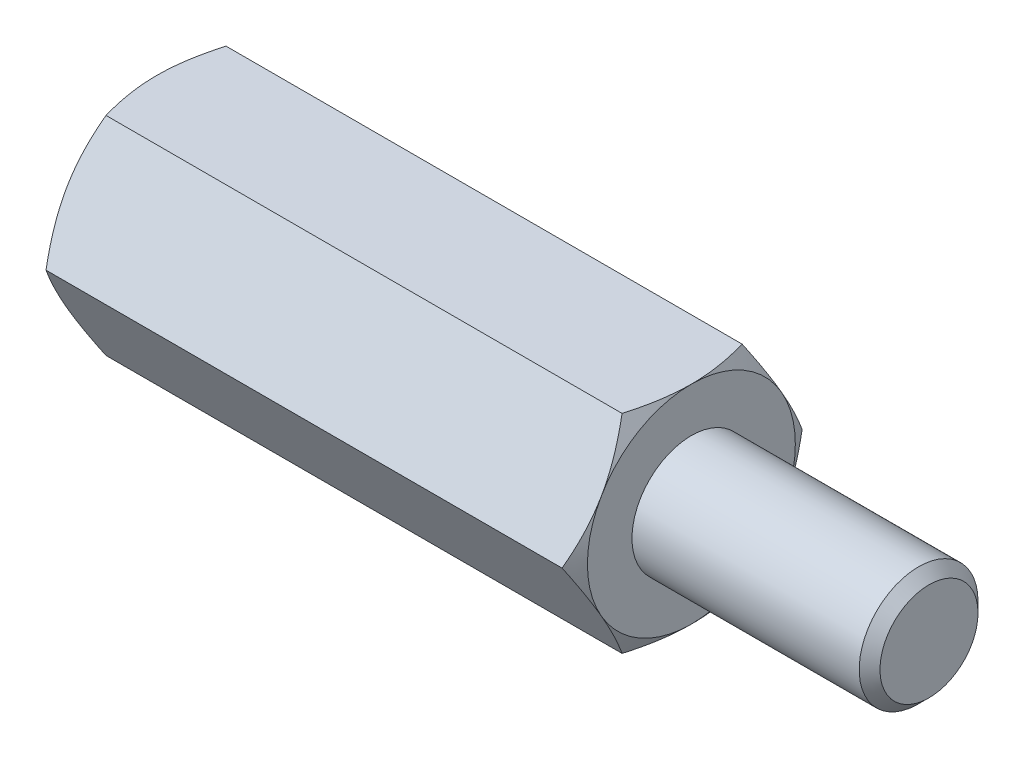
ISO-10303-21;
HEADER;
FILE_DESCRIPTION(('STEP AP214'),'2;1');
FILE_NAME('part.step','',(''),(''),'','','');
FILE_SCHEMA(('AUTOMOTIVE_DESIGN { 1 0 10303 214 1 1 1 1 }'));
ENDSEC;
DATA;
#1=APPLICATION_CONTEXT('core data for automotive mechanical design processes');
#2=APPLICATION_PROTOCOL_DEFINITION('international standard','automotive_design',2000,#1);
#3=PRODUCT_CONTEXT('',#1,'mechanical');
#4=PRODUCT('Part','Part','',(#3));
#5=PRODUCT_RELATED_PRODUCT_CATEGORY('part','',(#4));
#6=PRODUCT_DEFINITION_FORMATION('','',#4);
#7=PRODUCT_DEFINITION_CONTEXT('part definition',#1,'design');
#8=PRODUCT_DEFINITION('design','',#6,#7);
#9=PRODUCT_DEFINITION_SHAPE('','',#8);
#10=(LENGTH_UNIT() NAMED_UNIT(*) SI_UNIT(.MILLI.,.METRE.));
#11=(NAMED_UNIT(*) PLANE_ANGLE_UNIT() SI_UNIT($,.RADIAN.));
#12=(NAMED_UNIT(*) SI_UNIT($,.STERADIAN.) SOLID_ANGLE_UNIT());
#13=UNCERTAINTY_MEASURE_WITH_UNIT(LENGTH_MEASURE(1.E-05),#10,'distance_accuracy_value','');
#14=(GEOMETRIC_REPRESENTATION_CONTEXT(3) GLOBAL_UNCERTAINTY_ASSIGNED_CONTEXT((#13)) GLOBAL_UNIT_ASSIGNED_CONTEXT((#10,
#11,#12)) REPRESENTATION_CONTEXT('',''));
#15=CARTESIAN_POINT('',(0.,0.,0.));
#16=DIRECTION('',(0.,0.,1.));
#17=DIRECTION('',(1.,0.,0.));
#18=AXIS2_PLACEMENT_3D('',#15,#16,#17);
#19=CARTESIAN_POINT('',(9.,3.5,-2.02072594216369));
#20=DIRECTION('',(1.,0.,0.));
#21=DIRECTION('',(0.,0.,-1.));
#22=AXIS2_PLACEMENT_3D('',#19,#20,#21);
#23=PLANE('',#22);
#24=CARTESIAN_POINT('',(9.,0.,0.));
#25=DIRECTION('',(1.,0.,0.));
#26=DIRECTION('',(0.,0.,-1.));
#27=AXIS2_PLACEMENT_3D('',#24,#25,#26);
#28=CIRCLE('',#27,3.5);
#29=CARTESIAN_POINT('',(9.,-1.75,-3.03108891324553));
#30=VERTEX_POINT('',#29);
#31=CARTESIAN_POINT('',(9.,1.75,-3.03108891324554));
#32=VERTEX_POINT('',#31);
#33=EDGE_CURVE('E288',#30,#32,#28,.T.);
#34=ORIENTED_EDGE('',*,*,#33,.T.);
#35=CARTESIAN_POINT('',(9.,3.5,0.));
#36=VERTEX_POINT('',#35);
#37=EDGE_CURVE('E53',#32,#36,#28,.T.);
#38=ORIENTED_EDGE('',*,*,#37,.T.);
#39=CARTESIAN_POINT('',(9.,1.75,3.03108891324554));
#40=VERTEX_POINT('',#39);
#41=EDGE_CURVE('E296',#36,#40,#28,.T.);
#42=ORIENTED_EDGE('',*,*,#41,.T.);
#43=CARTESIAN_POINT('',(9.,-1.75,3.03108891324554));
#44=VERTEX_POINT('',#43);
#45=EDGE_CURVE('E302',#40,#44,#28,.T.);
#46=ORIENTED_EDGE('',*,*,#45,.T.);
#47=CARTESIAN_POINT('',(9.,0.,0.));
#48=DIRECTION('',(-1.,0.,0.));
#49=DIRECTION('',(0.,-1.,0.));
#50=AXIS2_PLACEMENT_3D('',#47,#48,#49);
#51=CIRCLE('',#50,3.5);
#52=CARTESIAN_POINT('',(9.,-3.5,0.));
#53=VERTEX_POINT('',#52);
#54=EDGE_CURVE('E193',#53,#44,#51,.T.);
#55=ORIENTED_EDGE('',*,*,#54,.F.);
#56=EDGE_CURVE('E61',#53,#30,#28,.T.);
#57=ORIENTED_EDGE('',*,*,#56,.T.);
#58=EDGE_LOOP('',(#34,#38,#42,#46,#55,#57));
#59=FACE_BOUND('',#58,.T.);
#60=CARTESIAN_POINT('',(9.,0.,0.));
#61=DIRECTION('',(1.,0.,0.));
#62=DIRECTION('',(0.,0.,-1.));
#63=AXIS2_PLACEMENT_3D('',#60,#61,#62);
#64=CIRCLE('',#63,2.);
#65=CARTESIAN_POINT('',(9.,0.,-2.));
#66=VERTEX_POINT('',#65);
#67=EDGE_CURVE('E324',#66,#66,#64,.T.);
#68=ORIENTED_EDGE('',*,*,#67,.F.);
#69=EDGE_LOOP('',(#68));
#70=FACE_BOUND('',#69,.T.);
#71=ADVANCED_FACE('F37',(#59,#70),#23,.T.);
#72=CARTESIAN_POINT('',(9.,0.,-4.04145188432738));
#73=DIRECTION('',(0.,-0.5,0.866025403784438));
#74=DIRECTION('',(0.,-0.866025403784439,-0.5));
#75=AXIS2_PLACEMENT_3D('',#72,#73,#74);
#76=PLANE('',#75);
#77=CARTESIAN_POINT('',(8.68732593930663,-0.000200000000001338,-4.04156735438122));
#78=CARTESIAN_POINT('',(8.73861421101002,0.153607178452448,-3.9527667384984));
#79=CARTESIAN_POINT('',(8.78525904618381,0.308742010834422,-3.86319960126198));
#80=CARTESIAN_POINT('',(8.86667812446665,0.621698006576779,-3.68251437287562));
#81=CARTESIAN_POINT('',(8.90142356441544,0.779524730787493,-3.59139307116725));
#82=CARTESIAN_POINT('',(8.95550997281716,1.09322221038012,-3.41027974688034));
#83=CARTESIAN_POINT('',(8.97521091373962,1.24904469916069,-3.32031559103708));
#84=CARTESIAN_POINT('',(8.99872986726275,1.56142288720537,-3.13996396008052));
#85=CARTESIAN_POINT('',(9.00256735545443,1.71797745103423,-3.04957714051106));
#86=CARTESIAN_POINT('',(8.99458469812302,2.01050921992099,-2.88068384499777));
#87=CARTESIAN_POINT('',(8.98472456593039,2.1465302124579,-2.80215208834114));
#88=CARTESIAN_POINT('',(8.9534735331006,2.41768602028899,-2.64560020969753));
#89=CARTESIAN_POINT('',(8.9320719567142,2.55281989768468,-2.5675806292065));
#90=CARTESIAN_POINT('',(8.87856959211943,2.82453479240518,-2.41070596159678));
#91=CARTESIAN_POINT('',(8.84624200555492,2.96108141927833,-2.33187072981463));
#92=CARTESIAN_POINT('',(8.77287106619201,3.2321380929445,-2.17537608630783));
#93=CARTESIAN_POINT('',(8.73184495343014,3.36665161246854,-2.09771466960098));
#94=CARTESIAN_POINT('',(8.68732593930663,3.5002,-2.02061047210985));
#95=B_SPLINE_CURVE_WITH_KNOTS('',3,(#77,#78,#79,#80,#81,#82,#83,#84,#85,#86,#87,#88,#89,#90,#91,
#92,#93,#94),.UNSPECIFIED.,.F.,.F.,(4,2,2,2,2,2,2,2,4),(0.,0.554793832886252,1.11092123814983,
1.65328467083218,2.19498204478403,2.6666513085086,3.13875761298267,3.6213361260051,
4.10296698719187),.UNSPECIFIED.);
#96=CARTESIAN_POINT('',(8.68739260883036,0.,-4.04145188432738));
#97=VERTEX_POINT('',#96);
#98=EDGE_CURVE('E331',#97,#32,#95,.T.);
#99=ORIENTED_EDGE('',*,*,#98,.F.);
#100=DIRECTION('',(-1.,0.,0.));
#101=VECTOR('',#100,1.);
#102=CARTESIAN_POINT('',(9.,0.,-4.04145188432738));
#103=LINE('',#102,#101);
#104=CARTESIAN_POINT('',(-8.68739260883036,0.,-4.04145188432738));
#105=VERTEX_POINT('',#104);
#106=EDGE_CURVE('E264',#97,#105,#103,.T.);
#107=ORIENTED_EDGE('',*,*,#106,.T.);
#108=CARTESIAN_POINT('',(-8.68732593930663,3.5002,-2.02061047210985));
#109=CARTESIAN_POINT('',(-8.73861421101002,3.34639282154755,-2.10941108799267));
#110=CARTESIAN_POINT('',(-8.78525904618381,3.19125798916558,-2.19897822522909));
#111=CARTESIAN_POINT('',(-8.86667812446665,2.87830199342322,-2.37966345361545));
#112=CARTESIAN_POINT('',(-8.90142356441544,2.7204752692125,-2.47078475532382));
#113=CARTESIAN_POINT('',(-8.95550997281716,2.40677778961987,-2.65189807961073));
#114=CARTESIAN_POINT('',(-8.97521091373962,2.25095530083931,-2.74186223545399));
#115=CARTESIAN_POINT('',(-8.99872986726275,1.93857711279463,-2.92221386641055));
#116=CARTESIAN_POINT('',(-9.00256735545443,1.78202254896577,-3.01260068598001));
#117=CARTESIAN_POINT('',(-8.99458469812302,1.48949078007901,-3.1814939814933));
#118=CARTESIAN_POINT('',(-8.98472456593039,1.3534697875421,-3.26002573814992));
#119=CARTESIAN_POINT('',(-8.9534735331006,1.08231397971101,-3.41657761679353));
#120=CARTESIAN_POINT('',(-8.9320719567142,0.947180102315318,-3.49459719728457));
#121=CARTESIAN_POINT('',(-8.87856959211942,0.675465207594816,-3.65147186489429));
#122=CARTESIAN_POINT('',(-8.84624200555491,0.538918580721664,-3.73030709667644));
#123=CARTESIAN_POINT('',(-8.77287106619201,0.267861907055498,-3.88680174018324));
#124=CARTESIAN_POINT('',(-8.73184495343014,0.133348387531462,-3.96446315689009));
#125=CARTESIAN_POINT('',(-8.68732593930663,-0.00020000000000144,-4.04156735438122));
#126=B_SPLINE_CURVE_WITH_KNOTS('',3,(#108,#109,#110,#111,#112,#113,#114,#115,#116,#117,#118,
#119,#120,#121,#122,#123,#124,#125),.UNSPECIFIED.,.F.,.F.,(4,2,2,2,2,2,2,2,4),(0.,
0.554793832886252,1.11092123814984,1.65328467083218,2.19498204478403,2.6666513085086,
3.13875761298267,3.6213361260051,4.10296698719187),.UNSPECIFIED.);
#127=CARTESIAN_POINT('',(-9.,1.75,-3.03108891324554));
#128=VERTEX_POINT('',#127);
#129=EDGE_CURVE('E323',#128,#105,#126,.T.);
#130=ORIENTED_EDGE('',*,*,#129,.F.);
#131=CARTESIAN_POINT('',(-8.68739260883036,3.5,-2.02072594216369));
#132=VERTEX_POINT('',#131);
#133=EDGE_CURVE('E321',#132,#128,#126,.T.);
#134=ORIENTED_EDGE('',*,*,#133,.F.);
#135=DIRECTION('',(-1.,0.,0.));
#136=VECTOR('',#135,1.);
#137=CARTESIAN_POINT('',(9.,3.5,-2.02072594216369));
#138=LINE('',#137,#136);
#139=CARTESIAN_POINT('',(8.68739260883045,3.5,-2.02072594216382));
#140=VERTEX_POINT('',#139);
#141=EDGE_CURVE('E279',#140,#132,#138,.T.);
#142=ORIENTED_EDGE('',*,*,#141,.F.);
#143=EDGE_CURVE('E229',#32,#140,#95,.T.);
#144=ORIENTED_EDGE('',*,*,#143,.F.);
#145=EDGE_LOOP('',(#99,#107,#130,#134,#142,#144));
#146=FACE_BOUND('',#145,.T.);
#147=ADVANCED_FACE('F148',(#146),#76,.F.);
#148=CARTESIAN_POINT('',(9.,3.5,-2.02072594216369));
#149=DIRECTION('',(0.,-1.,0.));
#150=DIRECTION('',(0.,0.,-1.));
#151=AXIS2_PLACEMENT_3D('',#148,#149,#150);
#152=PLANE('',#151);
#153=CARTESIAN_POINT('',(7.24432944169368,3.5,-5.52571367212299));
#154=CARTESIAN_POINT('',(7.3192813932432,3.5,-5.37200190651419));
#155=CARTESIAN_POINT('',(7.39354243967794,3.5,-5.21794762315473));
#156=CARTESIAN_POINT('',(7.54029601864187,3.5,-4.90897223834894));
#157=CARTESIAN_POINT('',(7.61278829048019,3.5,-4.75405101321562));
#158=CARTESIAN_POINT('',(7.75596172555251,3.5,-4.44240758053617));
#159=CARTESIAN_POINT('',(7.82663168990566,3.5,-4.28568021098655));
#160=CARTESIAN_POINT('',(7.96520746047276,3.5,-3.97101270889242));
#161=CARTESIAN_POINT('',(8.03311339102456,3.5,-3.81307263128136));
#162=CARTESIAN_POINT('',(8.16771439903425,3.5,-3.49026114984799));
#163=CARTESIAN_POINT('',(8.2342871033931,3.5,-3.32533845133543));
#164=CARTESIAN_POINT('',(8.36262677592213,3.5,-2.99359992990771));
#165=CARTESIAN_POINT('',(8.42439321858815,3.5,-2.82678390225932));
#166=CARTESIAN_POINT('',(8.54157006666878,3.5,-2.49127529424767));
#167=CARTESIAN_POINT('',(8.59699254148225,3.5,-2.32258697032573));
#168=CARTESIAN_POINT('',(8.69976794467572,3.5,-1.98279215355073));
#169=CARTESIAN_POINT('',(8.74712331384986,3.5,-1.81168640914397));
#170=CARTESIAN_POINT('',(8.83129873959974,3.5,-1.46793354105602));
#171=CARTESIAN_POINT('',(8.86817965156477,3.5,-1.2953015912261));
#172=CARTESIAN_POINT('',(8.92939557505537,3.5,-0.947791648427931));
#173=CARTESIAN_POINT('',(8.953731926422,3.5,-0.77291389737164));
#174=CARTESIAN_POINT('',(8.9876038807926,3.5,-0.424108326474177));
#175=CARTESIAN_POINT('',(8.99733725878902,3.5,-0.25020019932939));
#176=CARTESIAN_POINT('',(9.00170533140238,3.5,0.0978233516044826));
#177=CARTESIAN_POINT('',(8.99633996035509,3.5,0.27193877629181));
#178=CARTESIAN_POINT('',(8.97501181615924,3.5,0.564711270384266));
#179=CARTESIAN_POINT('',(8.96289198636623,3.5,0.683667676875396));
#180=CARTESIAN_POINT('',(8.93230809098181,3.5,0.920767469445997));
#181=CARTESIAN_POINT('',(8.91384324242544,3.5,1.03891075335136));
#182=CARTESIAN_POINT('',(8.84989562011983,3.5,1.39193174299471));
#183=CARTESIAN_POINT('',(8.79586958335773,3.5,1.62528232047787));
#184=CARTESIAN_POINT('',(8.70145152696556,3.5,1.97433825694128));
#185=CARTESIAN_POINT('',(8.66729009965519,3.5,2.09183268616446));
#186=CARTESIAN_POINT('',(8.59523444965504,3.5,2.32568238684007));
#187=CARTESIAN_POINT('',(8.55734019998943,3.5,2.44203765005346));
#188=CARTESIAN_POINT('',(8.47844216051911,3.5,2.67364238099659));
#189=CARTESIAN_POINT('',(8.43743925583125,3.5,2.78889215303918));
#190=CARTESIAN_POINT('',(8.35282457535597,3.5,3.01842460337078));
#191=CARTESIAN_POINT('',(8.3092128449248,3.5,3.13270729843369));
#192=CARTESIAN_POINT('',(8.19582414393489,3.5,3.42150510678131));
#193=CARTESIAN_POINT('',(8.12456360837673,3.5,3.59543696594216));
#194=CARTESIAN_POINT('',(7.97810267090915,3.5,3.94163961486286));
#195=CARTESIAN_POINT('',(7.90290192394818,3.5,4.11391025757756));
#196=CARTESIAN_POINT('',(7.74942525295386,3.5,4.45713072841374));
#197=CARTESIAN_POINT('',(7.67114846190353,3.5,4.62808016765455));
#198=CARTESIAN_POINT('',(7.51218826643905,3.5,4.9688584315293));
#199=CARTESIAN_POINT('',(7.43150479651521,3.5,5.13868722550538));
#200=CARTESIAN_POINT('',(7.18638713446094,3.5,5.64726192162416));
#201=CARTESIAN_POINT('',(7.0190975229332,3.5,5.98463020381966));
#202=CARTESIAN_POINT('',(6.67958549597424,3.5,6.65678495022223));
#203=CARTESIAN_POINT('',(6.5073639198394,3.5,6.99157184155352));
#204=CARTESIAN_POINT('',(6.17608002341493,3.5,7.62749570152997));
#205=CARTESIAN_POINT('',(6.01732992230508,3.5,7.92879562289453));
#206=CARTESIAN_POINT('',(5.69774734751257,3.5,8.53030635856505));
#207=CARTESIAN_POINT('',(5.53691477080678,3.5,8.83051711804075));
#208=CARTESIAN_POINT('',(5.21417926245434,3.5,9.42918006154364));
#209=CARTESIAN_POINT('',(5.0522810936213,3.5,9.72763481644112));
#210=CARTESIAN_POINT('',(4.7272737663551,3.5,10.3238577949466));
#211=CARTESIAN_POINT('',(4.56416469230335,3.5,10.6216260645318));
#212=CARTESIAN_POINT('',(4.40061041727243,3.5,10.9191478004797));
#213=B_SPLINE_CURVE_WITH_KNOTS('',3,(#153,#154,#155,#156,#157,#158,#159,#160,#161,#162,#163,
#164,#165,#166,#167,#168,#169,#170,#171,#172,#173,#174,#175,#176,#177,#178,#179,#180,#181,#182,
#183,#184,#185,#186,#187,#188,#189,#190,#191,#192,#193,#194,#195,#196,#197,#198,#199,#200,#201,
#202,#203,#204,#205,#206,#207,#208,#209,#210,#211,#212),.UNSPECIFIED.,.F.,.F.,(4,2,2,2,2,2,2,2,
2,2,2,2,2,2,2,2,2,2,2,2,2,2,2,2,2,2,2,2,2,4),(0.,0.513041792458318,1.02615874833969,
1.5419080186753,2.05763406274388,2.59113284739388,3.1246898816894,3.65721433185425,
4.18957737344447,4.71878103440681,5.24792816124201,5.76984197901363,6.29175806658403,
6.65030258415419,7.0088913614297,7.72642330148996,8.09346920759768,8.46051776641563,
8.8274622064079,9.19440026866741,9.75822236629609,10.3220939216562,10.8861255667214,
11.4501725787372,12.579801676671,13.7092396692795,14.730918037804,15.7526471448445,
16.7712589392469,17.7898004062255),.UNSPECIFIED.);
#214=EDGE_CURVE('E227',#140,#36,#213,.T.);
#215=ORIENTED_EDGE('',*,*,#214,.F.);
#216=ORIENTED_EDGE('',*,*,#141,.T.);
#217=CARTESIAN_POINT('',(-7.24432944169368,3.5,-5.52571367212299));
#218=CARTESIAN_POINT('',(-7.3192813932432,3.5,-5.37200190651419));
#219=CARTESIAN_POINT('',(-7.39354243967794,3.5,-5.21794762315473));
#220=CARTESIAN_POINT('',(-7.54029601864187,3.5,-4.90897223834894));
#221=CARTESIAN_POINT('',(-7.61278829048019,3.5,-4.75405101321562));
#222=CARTESIAN_POINT('',(-7.75596172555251,3.5,-4.44240758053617));
#223=CARTESIAN_POINT('',(-7.82663168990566,3.5,-4.28568021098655));
#224=CARTESIAN_POINT('',(-7.96520746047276,3.5,-3.97101270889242));
#225=CARTESIAN_POINT('',(-8.03311339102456,3.5,-3.81307263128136));
#226=CARTESIAN_POINT('',(-8.16771439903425,3.5,-3.49026114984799));
#227=CARTESIAN_POINT('',(-8.2342871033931,3.5,-3.32533845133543));
#228=CARTESIAN_POINT('',(-8.36262677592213,3.5,-2.99359992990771));
#229=CARTESIAN_POINT('',(-8.42439321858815,3.5,-2.82678390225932));
#230=CARTESIAN_POINT('',(-8.54157006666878,3.5,-2.49127529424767));
#231=CARTESIAN_POINT('',(-8.59699254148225,3.5,-2.32258697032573));
#232=CARTESIAN_POINT('',(-8.69976794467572,3.5,-1.98279215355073));
#233=CARTESIAN_POINT('',(-8.74712331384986,3.5,-1.81168640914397));
#234=CARTESIAN_POINT('',(-8.83129873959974,3.5,-1.46793354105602));
#235=CARTESIAN_POINT('',(-8.86817965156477,3.5,-1.2953015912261));
#236=CARTESIAN_POINT('',(-8.92939557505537,3.5,-0.94779164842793));
#237=CARTESIAN_POINT('',(-8.953731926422,3.5,-0.772913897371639));
#238=CARTESIAN_POINT('',(-8.9876038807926,3.5,-0.424108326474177));
#239=CARTESIAN_POINT('',(-8.99733725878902,3.5,-0.25020019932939));
#240=CARTESIAN_POINT('',(-9.00170533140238,3.5,0.0978233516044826));
#241=CARTESIAN_POINT('',(-8.99633996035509,3.5,0.271938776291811));
#242=CARTESIAN_POINT('',(-8.97501181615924,3.5,0.564711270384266));
#243=CARTESIAN_POINT('',(-8.96289198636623,3.5,0.683667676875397));
#244=CARTESIAN_POINT('',(-8.93230809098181,3.5,0.920767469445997));
#245=CARTESIAN_POINT('',(-8.91384324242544,3.5,1.03891075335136));
#246=CARTESIAN_POINT('',(-8.84989562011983,3.5,1.39193174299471));
#247=CARTESIAN_POINT('',(-8.79586958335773,3.5,1.62528232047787));
#248=CARTESIAN_POINT('',(-8.70145152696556,3.5,1.97433825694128));
#249=CARTESIAN_POINT('',(-8.66729009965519,3.5,2.09183268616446));
#250=CARTESIAN_POINT('',(-8.59523444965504,3.5,2.32568238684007));
#251=CARTESIAN_POINT('',(-8.55734019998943,3.5,2.44203765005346));
#252=CARTESIAN_POINT('',(-8.47844216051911,3.5,2.67364238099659));
#253=CARTESIAN_POINT('',(-8.43743925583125,3.5,2.78889215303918));
#254=CARTESIAN_POINT('',(-8.35282457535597,3.5,3.01842460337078));
#255=CARTESIAN_POINT('',(-8.3092128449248,3.5,3.13270729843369));
#256=CARTESIAN_POINT('',(-8.19582414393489,3.5,3.42150510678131));
#257=CARTESIAN_POINT('',(-8.12456360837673,3.5,3.59543696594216));
#258=CARTESIAN_POINT('',(-7.97810267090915,3.5,3.94163961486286));
#259=CARTESIAN_POINT('',(-7.90290192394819,3.5,4.11391025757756));
#260=CARTESIAN_POINT('',(-7.74942525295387,3.5,4.45713072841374));
#261=CARTESIAN_POINT('',(-7.67114846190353,3.5,4.62808016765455));
#262=CARTESIAN_POINT('',(-7.51218826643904,3.5,4.9688584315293));
#263=CARTESIAN_POINT('',(-7.43150479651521,3.5,5.13868722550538));
#264=CARTESIAN_POINT('',(-7.18638713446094,3.5,5.64726192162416));
#265=CARTESIAN_POINT('',(-7.0190975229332,3.5,5.98463020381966));
#266=CARTESIAN_POINT('',(-6.67958549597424,3.5,6.65678495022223));
#267=CARTESIAN_POINT('',(-6.50736391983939,3.5,6.99157184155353));
#268=CARTESIAN_POINT('',(-6.17608002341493,3.5,7.62749570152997));
#269=CARTESIAN_POINT('',(-6.01732992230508,3.5,7.92879562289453));
#270=CARTESIAN_POINT('',(-5.69774734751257,3.5,8.53030635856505));
#271=CARTESIAN_POINT('',(-5.53691477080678,3.5,8.83051711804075));
#272=CARTESIAN_POINT('',(-5.21417926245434,3.5,9.42918006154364));
#273=CARTESIAN_POINT('',(-5.0522810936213,3.5,9.72763481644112));
#274=CARTESIAN_POINT('',(-4.7272737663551,3.5,10.3238577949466));
#275=CARTESIAN_POINT('',(-4.56416469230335,3.5,10.6216260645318));
#276=CARTESIAN_POINT('',(-4.40061041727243,3.5,10.9191478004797));
#277=B_SPLINE_CURVE_WITH_KNOTS('',3,(#217,#218,#219,#220,#221,#222,#223,#224,#225,#226,#227,
#228,#229,#230,#231,#232,#233,#234,#235,#236,#237,#238,#239,#240,#241,#242,#243,#244,#245,#246,
#247,#248,#249,#250,#251,#252,#253,#254,#255,#256,#257,#258,#259,#260,#261,#262,#263,#264,#265,
#266,#267,#268,#269,#270,#271,#272,#273,#274,#275,#276),.UNSPECIFIED.,.F.,.F.,(4,2,2,2,2,2,2,2,
2,2,2,2,2,2,2,2,2,2,2,2,2,2,2,2,2,2,2,2,2,4),(0.,0.513041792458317,1.02615874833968,
1.5419080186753,2.05763406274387,2.59113284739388,3.1246898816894,3.65721433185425,
4.18957737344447,4.71878103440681,5.24792816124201,5.76984197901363,6.29175806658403,
6.65030258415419,7.0088913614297,7.72642330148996,8.09346920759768,8.46051776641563,
8.8274622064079,9.19440026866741,9.75822236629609,10.3220939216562,10.8861255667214,
11.4501725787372,12.579801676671,13.7092396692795,14.730918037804,15.7526471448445,
16.7712589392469,17.7898004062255),.UNSPECIFIED.);
#278=CARTESIAN_POINT('',(-9.,3.5,0.));
#279=VERTEX_POINT('',#278);
#280=EDGE_CURVE('E241',#279,#132,#277,.F.);
#281=ORIENTED_EDGE('',*,*,#280,.F.);
#282=CARTESIAN_POINT('',(-8.68739260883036,3.5,2.02072594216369));
#283=VERTEX_POINT('',#282);
#284=EDGE_CURVE('E249',#283,#279,#277,.F.);
#285=ORIENTED_EDGE('',*,*,#284,.F.);
#286=DIRECTION('',(-1.,0.,0.));
#287=VECTOR('',#286,1.);
#288=CARTESIAN_POINT('',(9.,3.5,2.02072594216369));
#289=LINE('',#288,#287);
#290=CARTESIAN_POINT('',(8.68739260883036,3.5,2.02072594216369));
#291=VERTEX_POINT('',#290);
#292=EDGE_CURVE('E276',#291,#283,#289,.T.);
#293=ORIENTED_EDGE('',*,*,#292,.F.);
#294=EDGE_CURVE('E221',#36,#291,#213,.T.);
#295=ORIENTED_EDGE('',*,*,#294,.F.);
#296=EDGE_LOOP('',(#215,#216,#281,#285,#293,#295));
#297=FACE_BOUND('',#296,.T.);
#298=ADVANCED_FACE('F153',(#297),#152,.F.);
#299=CARTESIAN_POINT('',(9.,3.5,2.02072594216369));
#300=DIRECTION('',(0.,-0.5,-0.866025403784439));
#301=DIRECTION('',(0.,0.866025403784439,-0.5));
#302=AXIS2_PLACEMENT_3D('',#299,#300,#301);
#303=PLANE('',#302);
#304=CARTESIAN_POINT('',(8.68732593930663,3.5002,2.02061047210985));
#305=CARTESIAN_POINT('',(8.73861421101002,3.34639282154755,2.10941108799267));
#306=CARTESIAN_POINT('',(8.78525904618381,3.19125798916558,2.19897822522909));
#307=CARTESIAN_POINT('',(8.86667812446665,2.87830199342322,2.37966345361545));
#308=CARTESIAN_POINT('',(8.90142356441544,2.7204752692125,2.47078475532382));
#309=CARTESIAN_POINT('',(8.95550997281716,2.40677778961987,2.65189807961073));
#310=CARTESIAN_POINT('',(8.97521091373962,2.25095530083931,2.74186223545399));
#311=CARTESIAN_POINT('',(8.99872986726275,1.93857711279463,2.92221386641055));
#312=CARTESIAN_POINT('',(9.00256735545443,1.78202254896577,3.01260068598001));
#313=CARTESIAN_POINT('',(8.99458469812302,1.48949078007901,3.1814939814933));
#314=CARTESIAN_POINT('',(8.98472456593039,1.35346978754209,3.26002573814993));
#315=CARTESIAN_POINT('',(8.9534735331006,1.08231397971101,3.41657761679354));
#316=CARTESIAN_POINT('',(8.9320719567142,0.947180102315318,3.49459719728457));
#317=CARTESIAN_POINT('',(8.87856959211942,0.675465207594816,3.65147186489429));
#318=CARTESIAN_POINT('',(8.84624200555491,0.538918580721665,3.73030709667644));
#319=CARTESIAN_POINT('',(8.77287106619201,0.267861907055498,3.88680174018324));
#320=CARTESIAN_POINT('',(8.73184495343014,0.133348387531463,3.96446315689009));
#321=CARTESIAN_POINT('',(8.68732593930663,-0.000200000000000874,4.04156735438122));
#322=B_SPLINE_CURVE_WITH_KNOTS('',3,(#304,#305,#306,#307,#308,#309,#310,#311,#312,#313,#314,
#315,#316,#317,#318,#319,#320,#321),.UNSPECIFIED.,.F.,.F.,(4,2,2,2,2,2,2,2,4),(0.,
0.554793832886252,1.11092123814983,1.65328467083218,2.19498204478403,2.6666513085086,
3.13875761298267,3.62133612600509,4.10296698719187),.UNSPECIFIED.);
#323=EDGE_CURVE('E228',#291,#40,#322,.T.);
#324=ORIENTED_EDGE('',*,*,#323,.F.);
#325=ORIENTED_EDGE('',*,*,#292,.T.);
#326=CARTESIAN_POINT('',(-8.68732593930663,-0.000200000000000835,4.04156735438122));
#327=CARTESIAN_POINT('',(-8.73861421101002,0.153607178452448,3.9527667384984));
#328=CARTESIAN_POINT('',(-8.78525904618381,0.308742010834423,3.86319960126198));
#329=CARTESIAN_POINT('',(-8.86667812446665,0.62169800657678,3.68251437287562));
#330=CARTESIAN_POINT('',(-8.90142356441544,0.779524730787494,3.59139307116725));
#331=CARTESIAN_POINT('',(-8.95550997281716,1.09322221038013,3.41027974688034));
#332=CARTESIAN_POINT('',(-8.97521091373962,1.24904469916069,3.32031559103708));
#333=CARTESIAN_POINT('',(-8.99872986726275,1.56142288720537,3.13996396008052));
#334=CARTESIAN_POINT('',(-9.00256735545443,1.71797745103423,3.04957714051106));
#335=CARTESIAN_POINT('',(-8.99458469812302,2.01050921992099,2.88068384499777));
#336=CARTESIAN_POINT('',(-8.98472456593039,2.1465302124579,2.80215208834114));
#337=CARTESIAN_POINT('',(-8.9534735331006,2.41768602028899,2.64560020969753));
#338=CARTESIAN_POINT('',(-8.9320719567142,2.55281989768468,2.5675806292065));
#339=CARTESIAN_POINT('',(-8.87856959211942,2.82453479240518,2.41070596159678));
#340=CARTESIAN_POINT('',(-8.84624200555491,2.96108141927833,2.33187072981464));
#341=CARTESIAN_POINT('',(-8.77287106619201,3.2321380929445,2.17537608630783));
#342=CARTESIAN_POINT('',(-8.73184495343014,3.36665161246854,2.09771466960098));
#343=CARTESIAN_POINT('',(-8.68732593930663,3.5002,2.02061047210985));
#344=B_SPLINE_CURVE_WITH_KNOTS('',3,(#326,#327,#328,#329,#330,#331,#332,#333,#334,#335,#336,
#337,#338,#339,#340,#341,#342,#343),.UNSPECIFIED.,.F.,.F.,(4,2,2,2,2,2,2,2,4),(0.,
0.554793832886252,1.11092123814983,1.65328467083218,2.19498204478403,2.6666513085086,
3.13875761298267,3.62133612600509,4.10296698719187),.UNSPECIFIED.);
#345=CARTESIAN_POINT('',(-9.,1.75,3.03108891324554));
#346=VERTEX_POINT('',#345);
#347=EDGE_CURVE('E255',#346,#283,#344,.T.);
#348=ORIENTED_EDGE('',*,*,#347,.F.);
#349=CARTESIAN_POINT('',(-8.68739260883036,0.,4.04145188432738));
#350=VERTEX_POINT('',#349);
#351=EDGE_CURVE('E262',#350,#346,#344,.T.);
#352=ORIENTED_EDGE('',*,*,#351,.F.);
#353=DIRECTION('',(-1.,0.,0.));
#354=VECTOR('',#353,1.);
#355=CARTESIAN_POINT('',(9.,0.,4.04145188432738));
#356=LINE('',#355,#354);
#357=CARTESIAN_POINT('',(8.68739260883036,0.,4.04145188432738));
#358=VERTEX_POINT('',#357);
#359=EDGE_CURVE('E273',#358,#350,#356,.T.);
#360=ORIENTED_EDGE('',*,*,#359,.F.);
#361=EDGE_CURVE('E215',#40,#358,#322,.T.);
#362=ORIENTED_EDGE('',*,*,#361,.F.);
#363=EDGE_LOOP('',(#324,#325,#348,#352,#360,#362));
#364=FACE_BOUND('',#363,.T.);
#365=ADVANCED_FACE('F235',(#364),#303,.F.);
#366=CARTESIAN_POINT('',(9.,0.,4.04145188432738));
#367=DIRECTION('',(0.,0.5,-0.866025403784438));
#368=DIRECTION('',(0.,0.866025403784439,0.5));
#369=AXIS2_PLACEMENT_3D('',#366,#367,#368);
#370=PLANE('',#369);
#371=CARTESIAN_POINT('',(8.68732593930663,0.000199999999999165,4.04156735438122));
#372=CARTESIAN_POINT('',(8.73861421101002,-0.15360717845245,3.9527667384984));
#373=CARTESIAN_POINT('',(8.78525904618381,-0.308742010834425,3.86319960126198));
#374=CARTESIAN_POINT('',(8.86667812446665,-0.621698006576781,3.68251437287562));
#375=CARTESIAN_POINT('',(8.90142356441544,-0.779524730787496,3.59139307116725));
#376=CARTESIAN_POINT('',(8.95550997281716,-1.09322221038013,3.41027974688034));
#377=CARTESIAN_POINT('',(8.97521091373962,-1.24904469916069,3.32031559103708));
#378=CARTESIAN_POINT('',(8.99872986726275,-1.56142288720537,3.13996396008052));
#379=CARTESIAN_POINT('',(9.00256735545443,-1.71797745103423,3.04957714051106));
#380=CARTESIAN_POINT('',(8.99458469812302,-2.01050921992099,2.88068384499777));
#381=CARTESIAN_POINT('',(8.98472456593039,-2.1465302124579,2.80215208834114));
#382=CARTESIAN_POINT('',(8.9534735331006,-2.41768602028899,2.64560020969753));
#383=CARTESIAN_POINT('',(8.9320719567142,-2.55281989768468,2.5675806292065));
#384=CARTESIAN_POINT('',(8.87856959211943,-2.82453479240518,2.41070596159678));
#385=CARTESIAN_POINT('',(8.84624200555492,-2.96108141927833,2.33187072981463));
#386=CARTESIAN_POINT('',(8.77287106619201,-3.2321380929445,2.17537608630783));
#387=CARTESIAN_POINT('',(8.73184495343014,-3.36665161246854,2.09771466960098));
#388=CARTESIAN_POINT('',(8.68732593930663,-3.5002,2.02061047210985));
#389=B_SPLINE_CURVE_WITH_KNOTS('',3,(#371,#372,#373,#374,#375,#376,#377,#378,#379,#380,#381,
#382,#383,#384,#385,#386,#387,#388),.UNSPECIFIED.,.F.,.F.,(4,2,2,2,2,2,2,2,4),(0.,
0.554793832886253,1.11092123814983,1.65328467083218,2.19498204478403,2.6666513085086,
3.13875761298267,3.62133612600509,4.10296698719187),.UNSPECIFIED.);
#390=EDGE_CURVE('E312',#358,#44,#389,.T.);
#391=ORIENTED_EDGE('',*,*,#390,.F.);
#392=ORIENTED_EDGE('',*,*,#359,.T.);
#393=CARTESIAN_POINT('',(-8.68732593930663,-3.5002,2.02061047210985));
#394=CARTESIAN_POINT('',(-8.73861421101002,-3.34639282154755,2.10941108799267));
#395=CARTESIAN_POINT('',(-8.78525904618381,-3.19125798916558,2.19897822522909));
#396=CARTESIAN_POINT('',(-8.86667812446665,-2.87830199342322,2.37966345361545));
#397=CARTESIAN_POINT('',(-8.90142356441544,-2.72047526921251,2.47078475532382));
#398=CARTESIAN_POINT('',(-8.95550997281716,-2.40677778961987,2.65189807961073));
#399=CARTESIAN_POINT('',(-8.97521091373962,-2.25095530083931,2.74186223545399));
#400=CARTESIAN_POINT('',(-8.99872986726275,-1.93857711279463,2.92221386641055));
#401=CARTESIAN_POINT('',(-9.00256735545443,-1.78202254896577,3.01260068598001));
#402=CARTESIAN_POINT('',(-8.99458469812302,-1.48949078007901,3.1814939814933));
#403=CARTESIAN_POINT('',(-8.98472456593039,-1.3534697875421,3.26002573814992));
#404=CARTESIAN_POINT('',(-8.9534735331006,-1.08231397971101,3.41657761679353));
#405=CARTESIAN_POINT('',(-8.9320719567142,-0.947180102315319,3.49459719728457));
#406=CARTESIAN_POINT('',(-8.87856959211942,-0.675465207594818,3.65147186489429));
#407=CARTESIAN_POINT('',(-8.84624200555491,-0.538918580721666,3.73030709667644));
#408=CARTESIAN_POINT('',(-8.77287106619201,-0.2678619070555,3.88680174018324));
#409=CARTESIAN_POINT('',(-8.73184495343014,-0.133348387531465,3.96446315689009));
#410=CARTESIAN_POINT('',(-8.68732593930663,0.000199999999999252,4.04156735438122));
#411=B_SPLINE_CURVE_WITH_KNOTS('',3,(#393,#394,#395,#396,#397,#398,#399,#400,#401,#402,#403,
#404,#405,#406,#407,#408,#409,#410),.UNSPECIFIED.,.F.,.F.,(4,2,2,2,2,2,2,2,4),(0.,
0.554793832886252,1.11092123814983,1.65328467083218,2.19498204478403,2.6666513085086,
3.13875761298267,3.62133612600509,4.10296698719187),.UNSPECIFIED.);
#412=CARTESIAN_POINT('',(-9.,-1.75,3.03108891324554));
#413=VERTEX_POINT('',#412);
#414=EDGE_CURVE('E263',#413,#350,#411,.T.);
#415=ORIENTED_EDGE('',*,*,#414,.F.);
#416=CARTESIAN_POINT('',(-8.68739260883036,-3.5,2.02072594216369));
#417=VERTEX_POINT('',#416);
#418=EDGE_CURVE('E250',#417,#413,#411,.T.);
#419=ORIENTED_EDGE('',*,*,#418,.F.);
#420=DIRECTION('',(-1.,0.,0.));
#421=VECTOR('',#420,1.);
#422=CARTESIAN_POINT('',(9.,-3.5,2.02072594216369));
#423=LINE('',#422,#421);
#424=CARTESIAN_POINT('',(8.68739260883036,-3.5,2.02072594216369));
#425=VERTEX_POINT('',#424);
#426=EDGE_CURVE('E270',#425,#417,#423,.T.);
#427=ORIENTED_EDGE('',*,*,#426,.F.);
#428=EDGE_CURVE('E210',#44,#425,#389,.T.);
#429=ORIENTED_EDGE('',*,*,#428,.F.);
#430=EDGE_LOOP('',(#391,#392,#415,#419,#427,#429));
#431=FACE_BOUND('',#430,.T.);
#432=ADVANCED_FACE('F376',(#431),#370,.F.);
#433=CARTESIAN_POINT('',(9.,-3.5,2.02072594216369));
#434=DIRECTION('',(0.,1.,0.));
#435=DIRECTION('',(0.,0.,1.));
#436=AXIS2_PLACEMENT_3D('',#433,#434,#435);
#437=PLANE('',#436);
#438=CARTESIAN_POINT('',(7.24432944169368,-3.5,-5.525713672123));
#439=CARTESIAN_POINT('',(7.3192813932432,-3.5,-5.37200190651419));
#440=CARTESIAN_POINT('',(7.39354243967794,-3.5,-5.21794762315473));
#441=CARTESIAN_POINT('',(7.54029601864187,-3.5,-4.90897223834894));
#442=CARTESIAN_POINT('',(7.61278829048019,-3.5,-4.75405101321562));
#443=CARTESIAN_POINT('',(7.75596172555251,-3.5,-4.44240758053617));
#444=CARTESIAN_POINT('',(7.82663168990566,-3.5,-4.28568021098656));
#445=CARTESIAN_POINT('',(7.96520746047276,-3.5,-3.97101270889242));
#446=CARTESIAN_POINT('',(8.03311339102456,-3.5,-3.81307263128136));
#447=CARTESIAN_POINT('',(8.16771439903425,-3.5,-3.49026114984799));
#448=CARTESIAN_POINT('',(8.2342871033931,-3.5,-3.32533845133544));
#449=CARTESIAN_POINT('',(8.36262677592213,-3.5,-2.99359992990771));
#450=CARTESIAN_POINT('',(8.42439321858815,-3.5,-2.82678390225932));
#451=CARTESIAN_POINT('',(8.54157006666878,-3.5,-2.49127529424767));
#452=CARTESIAN_POINT('',(8.59699254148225,-3.5,-2.32258697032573));
#453=CARTESIAN_POINT('',(8.69976794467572,-3.5,-1.98279215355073));
#454=CARTESIAN_POINT('',(8.74712331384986,-3.5,-1.81168640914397));
#455=CARTESIAN_POINT('',(8.83129873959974,-3.5,-1.46793354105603));
#456=CARTESIAN_POINT('',(8.86817965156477,-3.5,-1.2953015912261));
#457=CARTESIAN_POINT('',(8.92939557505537,-3.5,-0.947791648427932));
#458=CARTESIAN_POINT('',(8.95373192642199,-3.5,-0.772913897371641));
#459=CARTESIAN_POINT('',(8.9876038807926,-3.5,-0.424108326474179));
#460=CARTESIAN_POINT('',(8.99733725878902,-3.5,-0.250200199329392));
#461=CARTESIAN_POINT('',(9.00170533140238,-3.5,0.0978233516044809));
#462=CARTESIAN_POINT('',(8.99633996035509,-3.5,0.271938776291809));
#463=CARTESIAN_POINT('',(8.97501181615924,-3.5,0.564711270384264));
#464=CARTESIAN_POINT('',(8.96289198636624,-3.5,0.683667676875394));
#465=CARTESIAN_POINT('',(8.93230809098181,-3.5,0.920767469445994));
#466=CARTESIAN_POINT('',(8.91384324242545,-3.5,1.03891075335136));
#467=CARTESIAN_POINT('',(8.84989562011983,-3.5,1.39193174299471));
#468=CARTESIAN_POINT('',(8.79586958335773,-3.5,1.62528232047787));
#469=CARTESIAN_POINT('',(8.70145152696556,-3.5,1.97433825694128));
#470=CARTESIAN_POINT('',(8.66729009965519,-3.5,2.09183268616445));
#471=CARTESIAN_POINT('',(8.59523444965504,-3.5,2.32568238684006));
#472=CARTESIAN_POINT('',(8.55734019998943,-3.5,2.44203765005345));
#473=CARTESIAN_POINT('',(8.47844216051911,-3.5,2.67364238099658));
#474=CARTESIAN_POINT('',(8.43743925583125,-3.5,2.78889215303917));
#475=CARTESIAN_POINT('',(8.35282457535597,-3.5,3.01842460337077));
#476=CARTESIAN_POINT('',(8.3092128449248,-3.5,3.13270729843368));
#477=CARTESIAN_POINT('',(8.19582414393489,-3.5,3.42150510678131));
#478=CARTESIAN_POINT('',(8.12456360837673,-3.5,3.59543696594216));
#479=CARTESIAN_POINT('',(7.97810267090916,-3.5,3.94163961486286));
#480=CARTESIAN_POINT('',(7.90290192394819,-3.5,4.11391025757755));
#481=CARTESIAN_POINT('',(7.74942525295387,-3.5,4.45713072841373));
#482=CARTESIAN_POINT('',(7.67114846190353,-3.5,4.62808016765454));
#483=CARTESIAN_POINT('',(7.51218826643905,-3.5,4.96885843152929));
#484=CARTESIAN_POINT('',(7.43150479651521,-3.5,5.13868722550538));
#485=CARTESIAN_POINT('',(7.18638713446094,-3.5,5.64726192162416));
#486=CARTESIAN_POINT('',(7.0190975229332,-3.5,5.98463020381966));
#487=CARTESIAN_POINT('',(6.67958549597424,-3.5,6.65678495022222));
#488=CARTESIAN_POINT('',(6.5073639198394,-3.5,6.99157184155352));
#489=CARTESIAN_POINT('',(6.17608002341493,-3.5,7.62749570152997));
#490=CARTESIAN_POINT('',(6.01732992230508,-3.5,7.92879562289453));
#491=CARTESIAN_POINT('',(5.69774734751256,-3.5,8.53030635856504));
#492=CARTESIAN_POINT('',(5.53691477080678,-3.5,8.83051711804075));
#493=CARTESIAN_POINT('',(5.21417926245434,-3.5,9.42918006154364));
#494=CARTESIAN_POINT('',(5.0522810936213,-3.5,9.72763481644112));
#495=CARTESIAN_POINT('',(4.7272737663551,-3.5,10.3238577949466));
#496=CARTESIAN_POINT('',(4.56416469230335,-3.5,10.6216260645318));
#497=CARTESIAN_POINT('',(4.40061041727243,-3.5,10.9191478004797));
#498=B_SPLINE_CURVE_WITH_KNOTS('',3,(#438,#439,#440,#441,#442,#443,#444,#445,#446,#447,#448,
#449,#450,#451,#452,#453,#454,#455,#456,#457,#458,#459,#460,#461,#462,#463,#464,#465,#466,#467,
#468,#469,#470,#471,#472,#473,#474,#475,#476,#477,#478,#479,#480,#481,#482,#483,#484,#485,#486,
#487,#488,#489,#490,#491,#492,#493,#494,#495,#496,#497),.UNSPECIFIED.,.F.,.F.,(4,2,2,2,2,2,2,2,
2,2,2,2,2,2,2,2,2,2,2,2,2,2,2,2,2,2,2,2,2,4),(0.,0.513041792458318,1.02615874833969,
1.5419080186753,2.05763406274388,2.59113284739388,3.1246898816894,3.65721433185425,
4.18957737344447,4.71878103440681,5.24792816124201,5.76984197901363,6.29175806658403,
6.65030258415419,7.0088913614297,7.72642330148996,8.09346920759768,8.46051776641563,
8.8274622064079,9.19440026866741,9.75822236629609,10.3220939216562,10.8861255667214,
11.4501725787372,12.579801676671,13.7092396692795,14.730918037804,15.7526471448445,
16.771258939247,17.7898004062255),.UNSPECIFIED.);
#499=EDGE_CURVE('E313',#425,#53,#498,.F.);
#500=ORIENTED_EDGE('',*,*,#499,.F.);
#501=ORIENTED_EDGE('',*,*,#426,.T.);
#502=CARTESIAN_POINT('',(-7.24432944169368,-3.5,-5.525713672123));
#503=CARTESIAN_POINT('',(-7.3192813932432,-3.5,-5.37200190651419));
#504=CARTESIAN_POINT('',(-7.39354243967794,-3.5,-5.21794762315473));
#505=CARTESIAN_POINT('',(-7.54029601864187,-3.5,-4.90897223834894));
#506=CARTESIAN_POINT('',(-7.61278829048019,-3.5,-4.75405101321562));
#507=CARTESIAN_POINT('',(-7.75596172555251,-3.5,-4.44240758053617));
#508=CARTESIAN_POINT('',(-7.82663168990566,-3.5,-4.28568021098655));
#509=CARTESIAN_POINT('',(-7.96520746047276,-3.5,-3.97101270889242));
#510=CARTESIAN_POINT('',(-8.03311339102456,-3.5,-3.81307263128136));
#511=CARTESIAN_POINT('',(-8.16771439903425,-3.5,-3.49026114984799));
#512=CARTESIAN_POINT('',(-8.2342871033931,-3.5,-3.32533845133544));
#513=CARTESIAN_POINT('',(-8.36262677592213,-3.5,-2.99359992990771));
#514=CARTESIAN_POINT('',(-8.42439321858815,-3.5,-2.82678390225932));
#515=CARTESIAN_POINT('',(-8.54157006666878,-3.5,-2.49127529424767));
#516=CARTESIAN_POINT('',(-8.59699254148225,-3.5,-2.32258697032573));
#517=CARTESIAN_POINT('',(-8.69976794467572,-3.5,-1.98279215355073));
#518=CARTESIAN_POINT('',(-8.74712331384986,-3.5,-1.81168640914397));
#519=CARTESIAN_POINT('',(-8.83129873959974,-3.5,-1.46793354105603));
#520=CARTESIAN_POINT('',(-8.86817965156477,-3.5,-1.2953015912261));
#521=CARTESIAN_POINT('',(-8.92939557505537,-3.5,-0.947791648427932));
#522=CARTESIAN_POINT('',(-8.95373192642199,-3.5,-0.772913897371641));
#523=CARTESIAN_POINT('',(-8.9876038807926,-3.5,-0.424108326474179));
#524=CARTESIAN_POINT('',(-8.99733725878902,-3.5,-0.250200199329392));
#525=CARTESIAN_POINT('',(-9.00170533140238,-3.5,0.097823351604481));
#526=CARTESIAN_POINT('',(-8.99633996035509,-3.5,0.271938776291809));
#527=CARTESIAN_POINT('',(-8.97501181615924,-3.5,0.564711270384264));
#528=CARTESIAN_POINT('',(-8.96289198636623,-3.5,0.683667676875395));
#529=CARTESIAN_POINT('',(-8.93230809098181,-3.5,0.920767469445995));
#530=CARTESIAN_POINT('',(-8.91384324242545,-3.5,1.03891075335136));
#531=CARTESIAN_POINT('',(-8.84989562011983,-3.5,1.39193174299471));
#532=CARTESIAN_POINT('',(-8.79586958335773,-3.5,1.62528232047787));
#533=CARTESIAN_POINT('',(-8.70145152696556,-3.5,1.97433825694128));
#534=CARTESIAN_POINT('',(-8.66729009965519,-3.5,2.09183268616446));
#535=CARTESIAN_POINT('',(-8.59523444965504,-3.5,2.32568238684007));
#536=CARTESIAN_POINT('',(-8.55734019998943,-3.5,2.44203765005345));
#537=CARTESIAN_POINT('',(-8.47844216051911,-3.5,2.67364238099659));
#538=CARTESIAN_POINT('',(-8.43743925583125,-3.5,2.78889215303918));
#539=CARTESIAN_POINT('',(-8.35282457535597,-3.5,3.01842460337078));
#540=CARTESIAN_POINT('',(-8.3092128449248,-3.5,3.13270729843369));
#541=CARTESIAN_POINT('',(-8.19582414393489,-3.5,3.42150510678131));
#542=CARTESIAN_POINT('',(-8.12456360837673,-3.5,3.59543696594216));
#543=CARTESIAN_POINT('',(-7.97810267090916,-3.5,3.94163961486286));
#544=CARTESIAN_POINT('',(-7.90290192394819,-3.5,4.11391025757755));
#545=CARTESIAN_POINT('',(-7.74942525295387,-3.5,4.45713072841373));
#546=CARTESIAN_POINT('',(-7.67114846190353,-3.5,4.62808016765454));
#547=CARTESIAN_POINT('',(-7.51218826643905,-3.5,4.96885843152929));
#548=CARTESIAN_POINT('',(-7.43150479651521,-3.5,5.13868722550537));
#549=CARTESIAN_POINT('',(-7.18638713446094,-3.5,5.64726192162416));
#550=CARTESIAN_POINT('',(-7.01909752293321,-3.5,5.98463020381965));
#551=CARTESIAN_POINT('',(-6.67958549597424,-3.5,6.65678495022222));
#552=CARTESIAN_POINT('',(-6.5073639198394,-3.5,6.99157184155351));
#553=CARTESIAN_POINT('',(-6.17608002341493,-3.5,7.62749570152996));
#554=CARTESIAN_POINT('',(-6.01732992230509,-3.5,7.92879562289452));
#555=CARTESIAN_POINT('',(-5.69774734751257,-3.5,8.53030635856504));
#556=CARTESIAN_POINT('',(-5.53691477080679,-3.5,8.83051711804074));
#557=CARTESIAN_POINT('',(-5.21417926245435,-3.5,9.42918006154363));
#558=CARTESIAN_POINT('',(-5.0522810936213,-3.5,9.72763481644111));
#559=CARTESIAN_POINT('',(-4.7272737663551,-3.5,10.3238577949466));
#560=CARTESIAN_POINT('',(-4.56416469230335,-3.5,10.6216260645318));
#561=CARTESIAN_POINT('',(-4.40061041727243,-3.5,10.9191478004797));
#562=B_SPLINE_CURVE_WITH_KNOTS('',3,(#502,#503,#504,#505,#506,#507,#508,#509,#510,#511,#512,
#513,#514,#515,#516,#517,#518,#519,#520,#521,#522,#523,#524,#525,#526,#527,#528,#529,#530,#531,
#532,#533,#534,#535,#536,#537,#538,#539,#540,#541,#542,#543,#544,#545,#546,#547,#548,#549,#550,
#551,#552,#553,#554,#555,#556,#557,#558,#559,#560,#561),.UNSPECIFIED.,.F.,.F.,(4,2,2,2,2,2,2,2,
2,2,2,2,2,2,2,2,2,2,2,2,2,2,2,2,2,2,2,2,2,4),(0.,0.513041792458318,1.02615874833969,
1.54190801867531,2.05763406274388,2.59113284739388,3.1246898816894,3.65721433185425,
4.18957737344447,4.71878103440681,5.24792816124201,5.76984197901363,6.29175806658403,
6.65030258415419,7.0088913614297,7.72642330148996,8.09346920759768,8.46051776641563,
8.8274622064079,9.19440026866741,9.75822236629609,10.3220939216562,10.8861255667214,
11.4501725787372,12.579801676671,13.7092396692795,14.730918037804,15.7526471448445,
16.7712589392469,17.7898004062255),.UNSPECIFIED.);
#563=CARTESIAN_POINT('',(-9.,-3.5,0.));
#564=VERTEX_POINT('',#563);
#565=EDGE_CURVE('E316',#564,#417,#562,.T.);
#566=ORIENTED_EDGE('',*,*,#565,.F.);
#567=CARTESIAN_POINT('',(-8.68739260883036,-3.5,-2.02072594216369));
#568=VERTEX_POINT('',#567);
#569=EDGE_CURVE('E356',#568,#564,#562,.T.);
#570=ORIENTED_EDGE('',*,*,#569,.F.);
#571=DIRECTION('',(-1.,0.,0.));
#572=VECTOR('',#571,1.);
#573=CARTESIAN_POINT('',(9.,-3.5,-2.02072594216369));
#574=LINE('',#573,#572);
#575=CARTESIAN_POINT('',(8.68739260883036,-3.5,-2.02072594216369));
#576=VERTEX_POINT('',#575);
#577=EDGE_CURVE('E267',#576,#568,#574,.T.);
#578=ORIENTED_EDGE('',*,*,#577,.F.);
#579=EDGE_CURVE('E195',#53,#576,#498,.F.);
#580=ORIENTED_EDGE('',*,*,#579,.F.);
#581=EDGE_LOOP('',(#500,#501,#566,#570,#578,#580));
#582=FACE_BOUND('',#581,.T.);
#583=ADVANCED_FACE('F172',(#582),#437,.F.);
#584=CARTESIAN_POINT('',(9.,-3.5,-2.02072594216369));
#585=DIRECTION('',(0.,0.5,0.866025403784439));
#586=DIRECTION('',(0.,-0.866025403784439,0.5));
#587=AXIS2_PLACEMENT_3D('',#584,#585,#586);
#588=PLANE('',#587);
#589=CARTESIAN_POINT('',(8.68732593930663,-3.5002,-2.02061047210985));
#590=CARTESIAN_POINT('',(8.73861421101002,-3.34639282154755,-2.10941108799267));
#591=CARTESIAN_POINT('',(8.78525904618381,-3.19125798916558,-2.19897822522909));
#592=CARTESIAN_POINT('',(8.86667812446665,-2.87830199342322,-2.37966345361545));
#593=CARTESIAN_POINT('',(8.90142356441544,-2.72047526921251,-2.47078475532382));
#594=CARTESIAN_POINT('',(8.95550997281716,-2.40677778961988,-2.65189807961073));
#595=CARTESIAN_POINT('',(8.97521091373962,-2.25095530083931,-2.74186223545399));
#596=CARTESIAN_POINT('',(8.99872986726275,-1.93857711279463,-2.92221386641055));
#597=CARTESIAN_POINT('',(9.00256735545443,-1.78202254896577,-3.01260068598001));
#598=CARTESIAN_POINT('',(8.99458469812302,-1.48949078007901,-3.1814939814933));
#599=CARTESIAN_POINT('',(8.98472456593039,-1.3534697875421,-3.26002573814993));
#600=CARTESIAN_POINT('',(8.9534735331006,-1.08231397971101,-3.41657761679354));
#601=CARTESIAN_POINT('',(8.9320719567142,-0.94718010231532,-3.49459719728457));
#602=CARTESIAN_POINT('',(8.87856959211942,-0.675465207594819,-3.65147186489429));
#603=CARTESIAN_POINT('',(8.84624200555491,-0.538918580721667,-3.73030709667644));
#604=CARTESIAN_POINT('',(8.77287106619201,-0.2678619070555,-3.88680174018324));
#605=CARTESIAN_POINT('',(8.73184495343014,-0.133348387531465,-3.96446315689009));
#606=CARTESIAN_POINT('',(8.68732593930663,0.000199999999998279,-4.04156735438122));
#607=B_SPLINE_CURVE_WITH_KNOTS('',3,(#589,#590,#591,#592,#593,#594,#595,#596,#597,#598,#599,
#600,#601,#602,#603,#604,#605,#606),.UNSPECIFIED.,.F.,.F.,(4,2,2,2,2,2,2,2,4),(0.,
0.554793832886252,1.11092123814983,1.65328467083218,2.19498204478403,2.6666513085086,
3.13875761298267,3.62133612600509,4.10296698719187),.UNSPECIFIED.);
#608=EDGE_CURVE('E192',#576,#30,#607,.T.);
#609=ORIENTED_EDGE('',*,*,#608,.F.);
#610=ORIENTED_EDGE('',*,*,#577,.T.);
#611=CARTESIAN_POINT('',(-8.68732593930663,0.000199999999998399,-4.04156735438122));
#612=CARTESIAN_POINT('',(-8.73861421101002,-0.153607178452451,-3.9527667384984));
#613=CARTESIAN_POINT('',(-8.78525904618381,-0.308742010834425,-3.86319960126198));
#614=CARTESIAN_POINT('',(-8.86667812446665,-0.621698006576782,-3.68251437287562));
#615=CARTESIAN_POINT('',(-8.90142356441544,-0.779524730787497,-3.59139307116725));
#616=CARTESIAN_POINT('',(-8.95550997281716,-1.09322221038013,-3.41027974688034));
#617=CARTESIAN_POINT('',(-8.97521091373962,-1.24904469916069,-3.32031559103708));
#618=CARTESIAN_POINT('',(-8.99872986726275,-1.56142288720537,-3.13996396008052));
#619=CARTESIAN_POINT('',(-9.00256735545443,-1.71797745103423,-3.04957714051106));
#620=CARTESIAN_POINT('',(-8.99458469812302,-2.01050921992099,-2.88068384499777));
#621=CARTESIAN_POINT('',(-8.98472456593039,-2.14653021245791,-2.80215208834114));
#622=CARTESIAN_POINT('',(-8.9534735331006,-2.41768602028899,-2.64560020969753));
#623=CARTESIAN_POINT('',(-8.9320719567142,-2.55281989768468,-2.5675806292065));
#624=CARTESIAN_POINT('',(-8.87856959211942,-2.82453479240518,-2.41070596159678));
#625=CARTESIAN_POINT('',(-8.84624200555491,-2.96108141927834,-2.33187072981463));
#626=CARTESIAN_POINT('',(-8.77287106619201,-3.2321380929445,-2.17537608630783));
#627=CARTESIAN_POINT('',(-8.73184495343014,-3.36665161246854,-2.09771466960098));
#628=CARTESIAN_POINT('',(-8.68732593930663,-3.5002,-2.02061047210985));
#629=B_SPLINE_CURVE_WITH_KNOTS('',3,(#611,#612,#613,#614,#615,#616,#617,#618,#619,#620,#621,
#622,#623,#624,#625,#626,#627,#628),.UNSPECIFIED.,.F.,.F.,(4,2,2,2,2,2,2,2,4),(0.,
0.554793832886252,1.11092123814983,1.65328467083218,2.19498204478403,2.6666513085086,
3.13875761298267,3.62133612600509,4.10296698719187),.UNSPECIFIED.);
#630=CARTESIAN_POINT('',(-9.,-1.75,-3.03108891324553));
#631=VERTEX_POINT('',#630);
#632=EDGE_CURVE('E178',#631,#568,#629,.T.);
#633=ORIENTED_EDGE('',*,*,#632,.F.);
#634=EDGE_CURVE('E349',#105,#631,#629,.T.);
#635=ORIENTED_EDGE('',*,*,#634,.F.);
#636=ORIENTED_EDGE('',*,*,#106,.F.);
#637=EDGE_CURVE('E185',#30,#97,#607,.T.);
#638=ORIENTED_EDGE('',*,*,#637,.F.);
#639=EDGE_LOOP('',(#609,#610,#633,#635,#636,#638));
#640=FACE_BOUND('',#639,.T.);
#641=ADVANCED_FACE('F167',(#640),#588,.F.);
#642=CARTESIAN_POINT('',(-9.,0.,0.));
#643=DIRECTION('',(1.,0.,0.));
#644=DIRECTION('',(0.,1.,0.));
#645=AXIS2_PLACEMENT_3D('',#642,#643,#644);
#646=CONICAL_SURFACE('',#645,3.5,1.0471975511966);
#647=ORIENTED_EDGE('',*,*,#129,.T.);
#648=ORIENTED_EDGE('',*,*,#634,.T.);
#649=CARTESIAN_POINT('',(-9.,0.,0.));
#650=DIRECTION('',(1.,0.,0.));
#651=DIRECTION('',(0.,0.,-1.));
#652=AXIS2_PLACEMENT_3D('',#649,#650,#651);
#653=CIRCLE('',#652,3.5);
#654=EDGE_CURVE('E282',#631,#128,#653,.T.);
#655=ORIENTED_EDGE('',*,*,#654,.T.);
#656=EDGE_LOOP('',(#647,#648,#655));
#657=FACE_BOUND('',#656,.T.);
#658=ADVANCED_FACE('F171',(#657),#646,.T.);
#659=ORIENTED_EDGE('',*,*,#569,.T.);
#660=EDGE_CURVE('E286',#564,#631,#653,.T.);
#661=ORIENTED_EDGE('',*,*,#660,.T.);
#662=ORIENTED_EDGE('',*,*,#632,.T.);
#663=EDGE_LOOP('',(#659,#661,#662));
#664=FACE_BOUND('',#663,.T.);
#665=ADVANCED_FACE('F408',(#664),#646,.T.);
#666=ORIENTED_EDGE('',*,*,#418,.T.);
#667=CARTESIAN_POINT('',(-9.,0.,0.));
#668=DIRECTION('',(-1.,0.,0.));
#669=DIRECTION('',(0.,-1.,0.));
#670=AXIS2_PLACEMENT_3D('',#667,#668,#669);
#671=CIRCLE('',#670,3.5);
#672=EDGE_CURVE('E335',#564,#413,#671,.T.);
#673=ORIENTED_EDGE('',*,*,#672,.F.);
#674=ORIENTED_EDGE('',*,*,#565,.T.);
#675=EDGE_LOOP('',(#666,#673,#674));
#676=FACE_BOUND('',#675,.T.);
#677=ADVANCED_FACE('F370',(#676),#646,.T.);
#678=ORIENTED_EDGE('',*,*,#351,.T.);
#679=EDGE_CURVE('E381',#346,#413,#653,.T.);
#680=ORIENTED_EDGE('',*,*,#679,.T.);
#681=ORIENTED_EDGE('',*,*,#414,.T.);
#682=EDGE_LOOP('',(#678,#680,#681));
#683=FACE_BOUND('',#682,.T.);
#684=ADVANCED_FACE('F158',(#683),#646,.T.);
#685=ORIENTED_EDGE('',*,*,#347,.T.);
#686=ORIENTED_EDGE('',*,*,#284,.T.);
#687=EDGE_CURVE('E407',#279,#346,#653,.T.);
#688=ORIENTED_EDGE('',*,*,#687,.T.);
#689=EDGE_LOOP('',(#685,#686,#688));
#690=FACE_BOUND('',#689,.T.);
#691=ADVANCED_FACE('F424',(#690),#646,.T.);
#692=ORIENTED_EDGE('',*,*,#280,.T.);
#693=ORIENTED_EDGE('',*,*,#133,.T.);
#694=EDGE_CURVE('E287',#128,#279,#653,.T.);
#695=ORIENTED_EDGE('',*,*,#694,.T.);
#696=EDGE_LOOP('',(#692,#693,#695));
#697=FACE_BOUND('',#696,.T.);
#698=ADVANCED_FACE('F165',(#697),#646,.T.);
#699=CARTESIAN_POINT('',(-9.,3.5,-2.02072594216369));
#700=DIRECTION('',(1.,0.,0.));
#701=DIRECTION('',(0.,0.,-1.));
#702=AXIS2_PLACEMENT_3D('',#699,#700,#701);
#703=PLANE('',#702);
#704=CARTESIAN_POINT('',(-9.,0.,0.));
#705=DIRECTION('',(-1.,0.,0.));
#706=DIRECTION('',(0.,0.,1.));
#707=AXIS2_PLACEMENT_3D('',#704,#705,#706);
#708=CIRCLE('',#707,1.65);
#709=CARTESIAN_POINT('',(-9.,0.,1.65));
#710=VERTEX_POINT('',#709);
#711=EDGE_CURVE('E397',#710,#710,#708,.T.);
#712=ORIENTED_EDGE('',*,*,#711,.F.);
#713=EDGE_LOOP('',(#712));
#714=FACE_BOUND('',#713,.T.);
#715=ORIENTED_EDGE('',*,*,#694,.F.);
#716=ORIENTED_EDGE('',*,*,#654,.F.);
#717=ORIENTED_EDGE('',*,*,#660,.F.);
#718=ORIENTED_EDGE('',*,*,#672,.T.);
#719=ORIENTED_EDGE('',*,*,#679,.F.);
#720=ORIENTED_EDGE('',*,*,#687,.F.);
#721=EDGE_LOOP('',(#715,#716,#717,#718,#719,#720));
#722=FACE_BOUND('',#721,.T.);
#723=ADVANCED_FACE('F161',(#714,#722),#703,.F.);
#724=CARTESIAN_POINT('',(9.,0.,0.));
#725=DIRECTION('',(-1.,0.,0.));
#726=DIRECTION('',(0.,1.,0.));
#727=AXIS2_PLACEMENT_3D('',#724,#725,#726);
#728=CONICAL_SURFACE('',#727,3.5,1.0471975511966);
#729=ORIENTED_EDGE('',*,*,#98,.T.);
#730=ORIENTED_EDGE('',*,*,#33,.F.);
#731=ORIENTED_EDGE('',*,*,#637,.T.);
#732=EDGE_LOOP('',(#729,#730,#731));
#733=FACE_BOUND('',#732,.T.);
#734=ADVANCED_FACE('F164',(#733),#728,.T.);
#735=ORIENTED_EDGE('',*,*,#579,.T.);
#736=ORIENTED_EDGE('',*,*,#608,.T.);
#737=ORIENTED_EDGE('',*,*,#56,.F.);
#738=EDGE_LOOP('',(#735,#736,#737));
#739=FACE_BOUND('',#738,.T.);
#740=ADVANCED_FACE('F202',(#739),#728,.T.);
#741=ORIENTED_EDGE('',*,*,#428,.T.);
#742=ORIENTED_EDGE('',*,*,#499,.T.);
#743=ORIENTED_EDGE('',*,*,#54,.T.);
#744=EDGE_LOOP('',(#741,#742,#743));
#745=FACE_BOUND('',#744,.T.);
#746=ADVANCED_FACE('F393',(#745),#728,.T.);
#747=ORIENTED_EDGE('',*,*,#361,.T.);
#748=ORIENTED_EDGE('',*,*,#390,.T.);
#749=ORIENTED_EDGE('',*,*,#45,.F.);
#750=EDGE_LOOP('',(#747,#748,#749));
#751=FACE_BOUND('',#750,.T.);
#752=ADVANCED_FACE('F390',(#751),#728,.T.);
#753=ORIENTED_EDGE('',*,*,#294,.T.);
#754=ORIENTED_EDGE('',*,*,#323,.T.);
#755=ORIENTED_EDGE('',*,*,#41,.F.);
#756=EDGE_LOOP('',(#753,#754,#755));
#757=FACE_BOUND('',#756,.T.);
#758=ADVANCED_FACE('F387',(#757),#728,.T.);
#759=ORIENTED_EDGE('',*,*,#143,.T.);
#760=ORIENTED_EDGE('',*,*,#214,.T.);
#761=ORIENTED_EDGE('',*,*,#37,.F.);
#762=EDGE_LOOP('',(#759,#760,#761));
#763=FACE_BOUND('',#762,.T.);
#764=ADVANCED_FACE('F143',(#763),#728,.T.);
#765=CARTESIAN_POINT('',(-0.999999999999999,0.,0.));
#766=DIRECTION('',(-1.,0.,0.));
#767=DIRECTION('',(0.,0.,1.));
#768=AXIS2_PLACEMENT_3D('',#765,#766,#767);
#769=CYLINDRICAL_SURFACE('',#768,1.65);
#770=CARTESIAN_POINT('',(-0.999999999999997,0.,0.));
#771=DIRECTION('',(1.,0.,0.));
#772=DIRECTION('',(0.,0.,-1.));
#773=AXIS2_PLACEMENT_3D('',#770,#771,#772);
#774=CIRCLE('',#773,1.65);
#775=CARTESIAN_POINT('',(-0.999999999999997,0.,-1.65));
#776=VERTEX_POINT('',#775);
#777=EDGE_CURVE('E326',#776,#776,#774,.T.);
#778=ORIENTED_EDGE('',*,*,#777,.T.);
#779=EDGE_LOOP('',(#778));
#780=FACE_BOUND('',#779,.T.);
#781=ORIENTED_EDGE('',*,*,#711,.T.);
#782=EDGE_LOOP('',(#781));
#783=FACE_BOUND('',#782,.T.);
#784=ADVANCED_FACE('F133',(#780,#783),#769,.F.);
#785=CARTESIAN_POINT('',(-0.0473720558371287,0.,0.));
#786=DIRECTION('',(-1.,0.,0.));
#787=DIRECTION('',(0.,0.,1.));
#788=AXIS2_PLACEMENT_3D('',#785,#786,#787);
#789=CONICAL_SURFACE('',#788,0.,1.0471975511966);
#790=ORIENTED_EDGE('',*,*,#777,.F.);
#791=EDGE_LOOP('',(#790));
#792=FACE_BOUND('',#791,.T.);
#793=CARTESIAN_POINT('',(-0.0473720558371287,0.,0.));
#794=VERTEX_POINT('',#793);
#795=VERTEX_LOOP('',#794);
#796=FACE_BOUND('',#795,.T.);
#797=ADVANCED_FACE('F130',(#792,#796),#789,.F.);
#798=CARTESIAN_POINT('',(17.,0.,0.));
#799=DIRECTION('',(-1.,0.,0.));
#800=DIRECTION('',(0.,0.,1.));
#801=AXIS2_PLACEMENT_3D('',#798,#799,#800);
#802=CYLINDRICAL_SURFACE('',#801,2.);
#803=CARTESIAN_POINT('',(16.65,0.,0.));
#804=DIRECTION('',(1.,0.,0.));
#805=DIRECTION('',(0.,0.,-1.));
#806=AXIS2_PLACEMENT_3D('',#803,#804,#805);
#807=CIRCLE('',#806,2.);
#808=CARTESIAN_POINT('',(16.65,0.,-2.));
#809=VERTEX_POINT('',#808);
#810=EDGE_CURVE('E11',#809,#809,#807,.F.);
#811=ORIENTED_EDGE('',*,*,#810,.T.);
#812=EDGE_LOOP('',(#811));
#813=FACE_BOUND('',#812,.T.);
#814=ORIENTED_EDGE('',*,*,#67,.T.);
#815=EDGE_LOOP('',(#814));
#816=FACE_BOUND('',#815,.T.);
#817=ADVANCED_FACE('F132',(#813,#816),#802,.T.);
#818=CARTESIAN_POINT('',(17.,0.,0.));
#819=DIRECTION('',(1.,0.,0.));
#820=DIRECTION('',(0.,0.,-1.));
#821=AXIS2_PLACEMENT_3D('',#818,#819,#820);
#822=PLANE('',#821);
#823=CARTESIAN_POINT('',(17.,0.,0.));
#824=DIRECTION('',(1.,0.,0.));
#825=DIRECTION('',(0.,0.,-1.));
#826=AXIS2_PLACEMENT_3D('',#823,#824,#825);
#827=CIRCLE('',#826,1.65000000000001);
#828=CARTESIAN_POINT('',(17.,0.,-1.65000000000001));
#829=VERTEX_POINT('',#828);
#830=EDGE_CURVE('E46',#829,#829,#827,.T.);
#831=ORIENTED_EDGE('',*,*,#830,.T.);
#832=EDGE_LOOP('',(#831));
#833=FACE_BOUND('',#832,.T.);
#834=ADVANCED_FACE('F140',(#833),#822,.T.);
#835=CARTESIAN_POINT('',(17.,0.,0.));
#836=DIRECTION('',(-1.,0.,0.));
#837=DIRECTION('',(0.,0.,1.));
#838=AXIS2_PLACEMENT_3D('',#835,#836,#837);
#839=CONICAL_SURFACE('',#838,1.65000000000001,0.785398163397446);
#840=ORIENTED_EDGE('',*,*,#810,.F.);
#841=EDGE_LOOP('',(#840));
#842=FACE_BOUND('',#841,.T.);
#843=ORIENTED_EDGE('',*,*,#830,.F.);
#844=EDGE_LOOP('',(#843));
#845=FACE_BOUND('',#844,.T.);
#846=ADVANCED_FACE('F39',(#842,#845),#839,.T.);
#847=CLOSED_SHELL('',(#71,#147,#298,#365,#432,#583,#641,#658,#665,#677,#684,#691,#698,#723,#734,
#740,#746,#752,#758,#764,#784,#797,#817,#834,#846));
#848=MANIFOLD_SOLID_BREP('B2',#847);
#849=ADVANCED_BREP_SHAPE_REPRESENTATION('',(#18,#848),#14);
#850=SHAPE_DEFINITION_REPRESENTATION(#9,#849);
ENDSEC;
END-ISO-10303-21;
